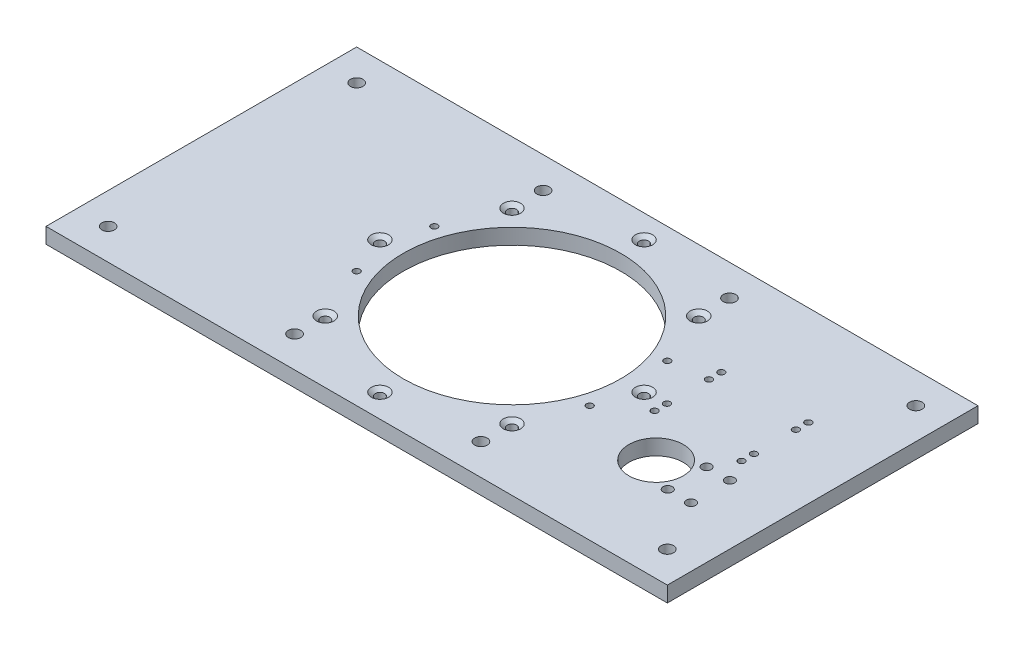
ISO-10303-21;
HEADER;
FILE_DESCRIPTION(('STEP AP214'),'2;1');
FILE_NAME('part.step','',(''),(''),'','','');
FILE_SCHEMA(('AUTOMOTIVE_DESIGN { 1 0 10303 214 1 1 1 1 }'));
ENDSEC;
DATA;
#1=APPLICATION_CONTEXT('core data for automotive mechanical design processes');
#2=APPLICATION_PROTOCOL_DEFINITION('international standard','automotive_design',2000,#1);
#3=PRODUCT_CONTEXT('',#1,'mechanical');
#4=PRODUCT('Part','Part','',(#3));
#5=PRODUCT_RELATED_PRODUCT_CATEGORY('part','',(#4));
#6=PRODUCT_DEFINITION_FORMATION('','',#4);
#7=PRODUCT_DEFINITION_CONTEXT('part definition',#1,'design');
#8=PRODUCT_DEFINITION('design','',#6,#7);
#9=PRODUCT_DEFINITION_SHAPE('','',#8);
#10=(LENGTH_UNIT() NAMED_UNIT(*) SI_UNIT(.MILLI.,.METRE.));
#11=(NAMED_UNIT(*) PLANE_ANGLE_UNIT() SI_UNIT($,.RADIAN.));
#12=(NAMED_UNIT(*) SI_UNIT($,.STERADIAN.) SOLID_ANGLE_UNIT());
#13=UNCERTAINTY_MEASURE_WITH_UNIT(LENGTH_MEASURE(1.E-05),#10,'distance_accuracy_value','');
#14=(GEOMETRIC_REPRESENTATION_CONTEXT(3) GLOBAL_UNCERTAINTY_ASSIGNED_CONTEXT((#13)) GLOBAL_UNIT_ASSIGNED_CONTEXT((#10,
#11,#12)) REPRESENTATION_CONTEXT('',''));
#15=CARTESIAN_POINT('',(0.,0.,0.));
#16=DIRECTION('',(0.,0.,1.));
#17=DIRECTION('',(1.,0.,0.));
#18=AXIS2_PLACEMENT_3D('',#15,#16,#17);
#19=CARTESIAN_POINT('',(-127.,6.35,-63.5));
#20=DIRECTION('',(0.,1.,0.));
#21=DIRECTION('',(0.,0.,1.));
#22=AXIS2_PLACEMENT_3D('',#19,#20,#21);
#23=PLANE('',#22);
#24=CARTESIAN_POINT('',(47.625,6.35,15.875));
#25=DIRECTION('',(0.,1.,0.));
#26=DIRECTION('',(0.,0.,1.));
#27=AXIS2_PLACEMENT_3D('',#24,#25,#26);
#28=CIRCLE('',#27,1.35254999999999);
#29=CARTESIAN_POINT('',(47.625,6.35,17.22755));
#30=VERTEX_POINT('',#29);
#31=EDGE_CURVE('E466',#30,#30,#28,.T.);
#32=ORIENTED_EDGE('',*,*,#31,.F.);
#33=EDGE_LOOP('',(#32));
#34=FACE_BOUND('',#33,.T.);
#35=CARTESIAN_POINT('',(47.625,6.35,-15.875));
#36=DIRECTION('',(0.,1.,0.));
#37=DIRECTION('',(0.,0.,1.));
#38=AXIS2_PLACEMENT_3D('',#35,#36,#37);
#39=CIRCLE('',#38,1.35254999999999);
#40=CARTESIAN_POINT('',(47.625,6.35,-14.52245));
#41=VERTEX_POINT('',#40);
#42=EDGE_CURVE('E460',#41,#41,#39,.T.);
#43=ORIENTED_EDGE('',*,*,#42,.F.);
#44=EDGE_LOOP('',(#43));
#45=FACE_BOUND('',#44,.T.);
#46=CARTESIAN_POINT('',(-47.625,6.35,-15.875));
#47=DIRECTION('',(0.,1.,0.));
#48=DIRECTION('',(0.,0.,1.));
#49=AXIS2_PLACEMENT_3D('',#46,#47,#48);
#50=CIRCLE('',#49,1.35254999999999);
#51=CARTESIAN_POINT('',(-47.625,6.35,-14.52245));
#52=VERTEX_POINT('',#51);
#53=EDGE_CURVE('E454',#52,#52,#50,.T.);
#54=ORIENTED_EDGE('',*,*,#53,.F.);
#55=EDGE_LOOP('',(#54));
#56=FACE_BOUND('',#55,.T.);
#57=CARTESIAN_POINT('',(-47.625,6.35,15.875));
#58=DIRECTION('',(0.,1.,0.));
#59=DIRECTION('',(0.,0.,1.));
#60=AXIS2_PLACEMENT_3D('',#57,#58,#59);
#61=CIRCLE('',#60,1.35254999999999);
#62=CARTESIAN_POINT('',(-47.625,6.35,17.22755));
#63=VERTEX_POINT('',#62);
#64=EDGE_CURVE('E448',#63,#63,#61,.T.);
#65=ORIENTED_EDGE('',*,*,#64,.F.);
#66=EDGE_LOOP('',(#65));
#67=FACE_BOUND('',#66,.T.);
#68=CARTESIAN_POINT('',(38.1660885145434,6.35,38.1660885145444));
#69=DIRECTION('',(0.,1.,0.));
#70=DIRECTION('',(0.,0.,1.));
#71=AXIS2_PLACEMENT_3D('',#68,#69,#70);
#72=CIRCLE('',#71,3.5433);
#73=CARTESIAN_POINT('',(38.1660885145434,6.35,41.7093885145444));
#74=VERTEX_POINT('',#73);
#75=EDGE_CURVE('E439',#74,#74,#72,.T.);
#76=ORIENTED_EDGE('',*,*,#75,.F.);
#77=EDGE_LOOP('',(#76));
#78=FACE_BOUND('',#77,.T.);
#79=CARTESIAN_POINT('',(53.975,6.35,5.65358443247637E-13));
#80=DIRECTION('',(0.,1.,0.));
#81=DIRECTION('',(0.,0.,1.));
#82=AXIS2_PLACEMENT_3D('',#79,#80,#81);
#83=CIRCLE('',#82,3.5433);
#84=CARTESIAN_POINT('',(53.975,6.35,3.54330000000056));
#85=VERTEX_POINT('',#84);
#86=EDGE_CURVE('E430',#85,#85,#83,.T.);
#87=ORIENTED_EDGE('',*,*,#86,.F.);
#88=EDGE_LOOP('',(#87));
#89=FACE_BOUND('',#88,.T.);
#90=CARTESIAN_POINT('',(38.1660885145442,6.35,-38.1660885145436));
#91=DIRECTION('',(0.,1.,0.));
#92=DIRECTION('',(0.,0.,1.));
#93=AXIS2_PLACEMENT_3D('',#90,#91,#92);
#94=CIRCLE('',#93,3.5433);
#95=CARTESIAN_POINT('',(38.1660885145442,6.35,-34.6227885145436));
#96=VERTEX_POINT('',#95);
#97=EDGE_CURVE('E421',#96,#96,#94,.T.);
#98=ORIENTED_EDGE('',*,*,#97,.F.);
#99=EDGE_LOOP('',(#98));
#100=FACE_BOUND('',#99,.T.);
#101=CARTESIAN_POINT('',(3.76905628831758E-13,6.35,-53.975));
#102=DIRECTION('',(0.,1.,0.));
#103=DIRECTION('',(0.,0.,1.));
#104=AXIS2_PLACEMENT_3D('',#101,#102,#103);
#105=CIRCLE('',#104,3.5433);
#106=CARTESIAN_POINT('',(3.76905628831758E-13,6.35,-50.4317));
#107=VERTEX_POINT('',#106);
#108=EDGE_CURVE('E412',#107,#107,#105,.T.);
#109=ORIENTED_EDGE('',*,*,#108,.F.);
#110=EDGE_LOOP('',(#109));
#111=FACE_BOUND('',#110,.T.);
#112=CARTESIAN_POINT('',(-38.1660885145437,6.35,-38.1660885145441));
#113=DIRECTION('',(0.,1.,0.));
#114=DIRECTION('',(0.,0.,1.));
#115=AXIS2_PLACEMENT_3D('',#112,#113,#114);
#116=CIRCLE('',#115,3.5433);
#117=CARTESIAN_POINT('',(-38.1660885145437,6.35,-34.6227885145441));
#118=VERTEX_POINT('',#117);
#119=EDGE_CURVE('E403',#118,#118,#116,.T.);
#120=ORIENTED_EDGE('',*,*,#119,.F.);
#121=EDGE_LOOP('',(#120));
#122=FACE_BOUND('',#121,.T.);
#123=CARTESIAN_POINT('',(-53.975,6.35,-1.88452814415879E-13));
#124=DIRECTION('',(0.,1.,0.));
#125=DIRECTION('',(0.,0.,1.));
#126=AXIS2_PLACEMENT_3D('',#123,#124,#125);
#127=CIRCLE('',#126,3.5433);
#128=CARTESIAN_POINT('',(-53.975,6.35,3.54329999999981));
#129=VERTEX_POINT('',#128);
#130=EDGE_CURVE('E394',#129,#129,#127,.T.);
#131=ORIENTED_EDGE('',*,*,#130,.F.);
#132=EDGE_LOOP('',(#131));
#133=FACE_BOUND('',#132,.T.);
#134=CARTESIAN_POINT('',(-38.166088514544,6.35,38.1660885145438));
#135=DIRECTION('',(0.,1.,0.));
#136=DIRECTION('',(0.,0.,1.));
#137=AXIS2_PLACEMENT_3D('',#134,#135,#136);
#138=CIRCLE('',#137,3.5433);
#139=CARTESIAN_POINT('',(-38.166088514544,6.35,41.7093885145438));
#140=VERTEX_POINT('',#139);
#141=EDGE_CURVE('E385',#140,#140,#138,.T.);
#142=ORIENTED_EDGE('',*,*,#141,.F.);
#143=EDGE_LOOP('',(#142));
#144=FACE_BOUND('',#143,.T.);
#145=CARTESIAN_POINT('',(0.,6.35,53.975));
#146=DIRECTION('',(0.,1.,0.));
#147=DIRECTION('',(0.,0.,1.));
#148=AXIS2_PLACEMENT_3D('',#145,#146,#147);
#149=CIRCLE('',#148,3.5433);
#150=CARTESIAN_POINT('',(0.,6.35,57.5183));
#151=VERTEX_POINT('',#150);
#152=EDGE_CURVE('E376',#151,#151,#149,.T.);
#153=ORIENTED_EDGE('',*,*,#152,.F.);
#154=EDGE_LOOP('',(#153));
#155=FACE_BOUND('',#154,.T.);
#156=CARTESIAN_POINT('',(38.1,6.35,50.8));
#157=DIRECTION('',(0.,1.,0.));
#158=DIRECTION('',(0.,0.,1.));
#159=AXIS2_PLACEMENT_3D('',#156,#157,#158);
#160=CIRCLE('',#159,2.55269999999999);
#161=CARTESIAN_POINT('',(38.1,6.35,53.3527));
#162=VERTEX_POINT('',#161);
#163=EDGE_CURVE('E373',#162,#162,#160,.T.);
#164=ORIENTED_EDGE('',*,*,#163,.F.);
#165=EDGE_LOOP('',(#164));
#166=FACE_BOUND('',#165,.T.);
#167=CARTESIAN_POINT('',(114.3,6.35,50.8));
#168=DIRECTION('',(0.,1.,0.));
#169=DIRECTION('',(0.,0.,1.));
#170=AXIS2_PLACEMENT_3D('',#167,#168,#169);
#171=CIRCLE('',#170,2.55269999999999);
#172=CARTESIAN_POINT('',(114.3,6.35,53.3527));
#173=VERTEX_POINT('',#172);
#174=EDGE_CURVE('E135',#173,#173,#171,.T.);
#175=ORIENTED_EDGE('',*,*,#174,.F.);
#176=EDGE_LOOP('',(#175));
#177=FACE_BOUND('',#176,.T.);
#178=CARTESIAN_POINT('',(98.253212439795,6.35,-22.8872677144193));
#179=DIRECTION('',(0.,1.,0.));
#180=DIRECTION('',(0.,0.,1.));
#181=AXIS2_PLACEMENT_3D('',#178,#179,#180);
#182=CIRCLE('',#181,1.35254999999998);
#183=CARTESIAN_POINT('',(98.253212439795,6.35,-21.5347177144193));
#184=VERTEX_POINT('',#183);
#185=EDGE_CURVE('E363',#184,#184,#182,.T.);
#186=ORIENTED_EDGE('',*,*,#185,.F.);
#187=EDGE_LOOP('',(#186));
#188=FACE_BOUND('',#187,.T.);
#189=CARTESIAN_POINT('',(62.693212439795,6.35,-17.8072677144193));
#190=DIRECTION('',(0.,1.,0.));
#191=DIRECTION('',(0.,0.,1.));
#192=AXIS2_PLACEMENT_3D('',#189,#190,#191);
#193=CIRCLE('',#192,1.35254999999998);
#194=CARTESIAN_POINT('',(62.693212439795,6.35,-16.4547177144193));
#195=VERTEX_POINT('',#194);
#196=EDGE_CURVE('E357',#195,#195,#193,.T.);
#197=ORIENTED_EDGE('',*,*,#196,.F.);
#198=EDGE_LOOP('',(#197));
#199=FACE_BOUND('',#198,.T.);
#200=CARTESIAN_POINT('',(98.253212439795,6.35,-17.8072677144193));
#201=DIRECTION('',(0.,1.,0.));
#202=DIRECTION('',(0.,0.,1.));
#203=AXIS2_PLACEMENT_3D('',#200,#201,#202);
#204=CIRCLE('',#203,1.35254999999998);
#205=CARTESIAN_POINT('',(98.253212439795,6.35,-16.4547177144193));
#206=VERTEX_POINT('',#205);
#207=EDGE_CURVE('E351',#206,#206,#204,.T.);
#208=ORIENTED_EDGE('',*,*,#207,.F.);
#209=EDGE_LOOP('',(#208));
#210=FACE_BOUND('',#209,.T.);
#211=CARTESIAN_POINT('',(62.693212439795,6.35,-22.8872677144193));
#212=DIRECTION('',(0.,1.,0.));
#213=DIRECTION('',(0.,0.,1.));
#214=AXIS2_PLACEMENT_3D('',#211,#212,#213);
#215=CIRCLE('',#214,1.35254999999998);
#216=CARTESIAN_POINT('',(62.693212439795,6.35,-21.5347177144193));
#217=VERTEX_POINT('',#216);
#218=EDGE_CURVE('E345',#217,#217,#215,.T.);
#219=ORIENTED_EDGE('',*,*,#218,.F.);
#220=EDGE_LOOP('',(#219));
#221=FACE_BOUND('',#220,.T.);
#222=CARTESIAN_POINT('',(62.693212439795,6.35,-0.662267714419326));
#223=DIRECTION('',(0.,1.,0.));
#224=DIRECTION('',(0.,0.,1.));
#225=AXIS2_PLACEMENT_3D('',#222,#223,#224);
#226=CIRCLE('',#225,1.35254999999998);
#227=CARTESIAN_POINT('',(62.693212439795,6.35,0.690282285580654));
#228=VERTEX_POINT('',#227);
#229=EDGE_CURVE('E339',#228,#228,#226,.T.);
#230=ORIENTED_EDGE('',*,*,#229,.F.);
#231=EDGE_LOOP('',(#230));
#232=FACE_BOUND('',#231,.T.);
#233=CARTESIAN_POINT('',(98.253212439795,6.35,-0.66226771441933));
#234=DIRECTION('',(0.,1.,0.));
#235=DIRECTION('',(0.,0.,1.));
#236=AXIS2_PLACEMENT_3D('',#233,#234,#235);
#237=CIRCLE('',#236,1.35254999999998);
#238=CARTESIAN_POINT('',(98.253212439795,6.35,0.69028228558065));
#239=VERTEX_POINT('',#238);
#240=EDGE_CURVE('E333',#239,#239,#237,.T.);
#241=ORIENTED_EDGE('',*,*,#240,.F.);
#242=EDGE_LOOP('',(#241));
#243=FACE_BOUND('',#242,.T.);
#244=CARTESIAN_POINT('',(62.693212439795,6.35,4.41773228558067));
#245=DIRECTION('',(0.,1.,0.));
#246=DIRECTION('',(0.,0.,1.));
#247=AXIS2_PLACEMENT_3D('',#244,#245,#246);
#248=CIRCLE('',#247,1.35254999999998);
#249=CARTESIAN_POINT('',(62.693212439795,6.35,5.77028228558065));
#250=VERTEX_POINT('',#249);
#251=EDGE_CURVE('E327',#250,#250,#248,.T.);
#252=ORIENTED_EDGE('',*,*,#251,.F.);
#253=EDGE_LOOP('',(#252));
#254=FACE_BOUND('',#253,.T.);
#255=CARTESIAN_POINT('',(98.253212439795,6.35,4.41773228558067));
#256=DIRECTION('',(0.,1.,0.));
#257=DIRECTION('',(0.,0.,1.));
#258=AXIS2_PLACEMENT_3D('',#255,#256,#257);
#259=CIRCLE('',#258,1.35254999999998);
#260=CARTESIAN_POINT('',(98.253212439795,6.35,5.77028228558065));
#261=VERTEX_POINT('',#260);
#262=EDGE_CURVE('E321',#261,#261,#259,.T.);
#263=ORIENTED_EDGE('',*,*,#262,.F.);
#264=EDGE_LOOP('',(#263));
#265=FACE_BOUND('',#264,.T.);
#266=CARTESIAN_POINT('',(93.173212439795,6.35,13.6252322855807));
#267=DIRECTION('',(0.,1.,0.));
#268=DIRECTION('',(0.,0.,1.));
#269=AXIS2_PLACEMENT_3D('',#266,#267,#268);
#270=CIRCLE('',#269,1.89864999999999);
#271=CARTESIAN_POINT('',(93.173212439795,6.35,15.5238822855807));
#272=VERTEX_POINT('',#271);
#273=EDGE_CURVE('E130',#272,#272,#270,.T.);
#274=ORIENTED_EDGE('',*,*,#273,.F.);
#275=EDGE_LOOP('',(#274));
#276=FACE_BOUND('',#275,.T.);
#277=CARTESIAN_POINT('',(93.173212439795,6.35,29.5002322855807));
#278=DIRECTION('',(0.,1.,0.));
#279=DIRECTION('',(0.,0.,1.));
#280=AXIS2_PLACEMENT_3D('',#277,#278,#279);
#281=CIRCLE('',#280,1.89864999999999);
#282=CARTESIAN_POINT('',(93.173212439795,6.35,31.3988822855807));
#283=VERTEX_POINT('',#282);
#284=EDGE_CURVE('E126',#283,#283,#281,.T.);
#285=ORIENTED_EDGE('',*,*,#284,.F.);
#286=EDGE_LOOP('',(#285));
#287=FACE_BOUND('',#286,.T.);
#288=CARTESIAN_POINT('',(102.698212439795,6.35,13.6252322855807));
#289=DIRECTION('',(0.,1.,0.));
#290=DIRECTION('',(0.,0.,1.));
#291=AXIS2_PLACEMENT_3D('',#288,#289,#290);
#292=CIRCLE('',#291,1.89864999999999);
#293=CARTESIAN_POINT('',(102.698212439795,6.35,15.5238822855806));
#294=VERTEX_POINT('',#293);
#295=EDGE_CURVE('E122',#294,#294,#292,.T.);
#296=ORIENTED_EDGE('',*,*,#295,.F.);
#297=EDGE_LOOP('',(#296));
#298=FACE_BOUND('',#297,.T.);
#299=CARTESIAN_POINT('',(102.698212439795,6.35,29.5002322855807));
#300=DIRECTION('',(0.,1.,0.));
#301=DIRECTION('',(0.,0.,1.));
#302=AXIS2_PLACEMENT_3D('',#299,#300,#301);
#303=CIRCLE('',#302,1.89864999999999);
#304=CARTESIAN_POINT('',(102.698212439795,6.35,31.3988822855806));
#305=VERTEX_POINT('',#304);
#306=EDGE_CURVE('E118',#305,#305,#303,.T.);
#307=ORIENTED_EDGE('',*,*,#306,.F.);
#308=EDGE_LOOP('',(#307));
#309=FACE_BOUND('',#308,.T.);
#310=CARTESIAN_POINT('',(80.473212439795,6.35,21.5627322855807));
#311=DIRECTION('',(0.,1.,0.));
#312=DIRECTION('',(0.,0.,1.));
#313=AXIS2_PLACEMENT_3D('',#310,#311,#312);
#314=CIRCLE('',#313,11.1125);
#315=CARTESIAN_POINT('',(80.473212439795,6.35,32.6752322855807));
#316=VERTEX_POINT('',#315);
#317=EDGE_CURVE('E117',#316,#316,#314,.T.);
#318=ORIENTED_EDGE('',*,*,#317,.F.);
#319=EDGE_LOOP('',(#318));
#320=FACE_BOUND('',#319,.T.);
#321=DIRECTION('',(0.,0.,1.));
#322=VECTOR('',#321,1.);
#323=CARTESIAN_POINT('',(-127.,6.35,-63.5));
#324=LINE('',#323,#322);
#325=CARTESIAN_POINT('',(-127.,6.35,-63.5));
#326=VERTEX_POINT('',#325);
#327=CARTESIAN_POINT('',(-127.,6.35,63.5));
#328=VERTEX_POINT('',#327);
#329=EDGE_CURVE('E104',#326,#328,#324,.T.);
#330=ORIENTED_EDGE('',*,*,#329,.T.);
#331=DIRECTION('',(1.,0.,0.));
#332=VECTOR('',#331,1.);
#333=CARTESIAN_POINT('',(-127.,6.35,63.5));
#334=LINE('',#333,#332);
#335=CARTESIAN_POINT('',(127.,6.35,63.5));
#336=VERTEX_POINT('',#335);
#337=EDGE_CURVE('E85',#328,#336,#334,.T.);
#338=ORIENTED_EDGE('',*,*,#337,.T.);
#339=DIRECTION('',(0.,0.,-1.));
#340=VECTOR('',#339,1.);
#341=CARTESIAN_POINT('',(127.,6.35,-63.5));
#342=LINE('',#341,#340);
#343=CARTESIAN_POINT('',(127.,6.35,-63.5));
#344=VERTEX_POINT('',#343);
#345=EDGE_CURVE('E49',#336,#344,#342,.T.);
#346=ORIENTED_EDGE('',*,*,#345,.T.);
#347=DIRECTION('',(-1.,0.,0.));
#348=VECTOR('',#347,1.);
#349=CARTESIAN_POINT('',(-127.,6.35,-63.5));
#350=LINE('',#349,#348);
#351=EDGE_CURVE('E44',#344,#326,#350,.T.);
#352=ORIENTED_EDGE('',*,*,#351,.T.);
#353=EDGE_LOOP('',(#330,#338,#346,#352));
#354=FACE_BOUND('',#353,.T.);
#355=CARTESIAN_POINT('',(0.,6.35,0.));
#356=DIRECTION('',(0.,1.,0.));
#357=DIRECTION('',(0.,0.,1.));
#358=AXIS2_PLACEMENT_3D('',#355,#356,#357);
#359=CIRCLE('',#358,44.45);
#360=CARTESIAN_POINT('',(0.,6.35,44.45));
#361=VERTEX_POINT('',#360);
#362=EDGE_CURVE('E94',#361,#361,#359,.T.);
#363=ORIENTED_EDGE('',*,*,#362,.F.);
#364=EDGE_LOOP('',(#363));
#365=FACE_BOUND('',#364,.T.);
#366=CARTESIAN_POINT('',(-38.1,6.35,50.8));
#367=DIRECTION('',(0.,1.,0.));
#368=DIRECTION('',(0.,0.,1.));
#369=AXIS2_PLACEMENT_3D('',#366,#367,#368);
#370=CIRCLE('',#369,2.55269999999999);
#371=CARTESIAN_POINT('',(-38.1,6.35,53.3527));
#372=VERTEX_POINT('',#371);
#373=EDGE_CURVE('E88',#372,#372,#370,.T.);
#374=ORIENTED_EDGE('',*,*,#373,.F.);
#375=EDGE_LOOP('',(#374));
#376=FACE_BOUND('',#375,.T.);
#377=CARTESIAN_POINT('',(-114.3,6.35,50.8));
#378=DIRECTION('',(0.,1.,0.));
#379=DIRECTION('',(0.,0.,1.));
#380=AXIS2_PLACEMENT_3D('',#377,#378,#379);
#381=CIRCLE('',#380,2.55269999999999);
#382=CARTESIAN_POINT('',(-114.3,6.35,53.3527));
#383=VERTEX_POINT('',#382);
#384=EDGE_CURVE('E141',#383,#383,#381,.T.);
#385=ORIENTED_EDGE('',*,*,#384,.F.);
#386=EDGE_LOOP('',(#385));
#387=FACE_BOUND('',#386,.T.);
#388=CARTESIAN_POINT('',(114.3,6.35,-50.8));
#389=DIRECTION('',(0.,1.,0.));
#390=DIRECTION('',(0.,0.,1.));
#391=AXIS2_PLACEMENT_3D('',#388,#389,#390);
#392=CIRCLE('',#391,2.55269999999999);
#393=CARTESIAN_POINT('',(114.3,6.35,-48.2473));
#394=VERTEX_POINT('',#393);
#395=EDGE_CURVE('E147',#394,#394,#392,.T.);
#396=ORIENTED_EDGE('',*,*,#395,.F.);
#397=EDGE_LOOP('',(#396));
#398=FACE_BOUND('',#397,.T.);
#399=CARTESIAN_POINT('',(38.1,6.35,-50.8));
#400=DIRECTION('',(0.,1.,0.));
#401=DIRECTION('',(0.,0.,1.));
#402=AXIS2_PLACEMENT_3D('',#399,#400,#401);
#403=CIRCLE('',#402,2.55269999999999);
#404=CARTESIAN_POINT('',(38.1,6.35,-48.2473));
#405=VERTEX_POINT('',#404);
#406=EDGE_CURVE('E153',#405,#405,#403,.T.);
#407=ORIENTED_EDGE('',*,*,#406,.F.);
#408=EDGE_LOOP('',(#407));
#409=FACE_BOUND('',#408,.T.);
#410=CARTESIAN_POINT('',(-38.1,6.35,-50.8));
#411=DIRECTION('',(0.,1.,0.));
#412=DIRECTION('',(0.,0.,1.));
#413=AXIS2_PLACEMENT_3D('',#410,#411,#412);
#414=CIRCLE('',#413,2.55269999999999);
#415=CARTESIAN_POINT('',(-38.1,6.35,-48.2473));
#416=VERTEX_POINT('',#415);
#417=EDGE_CURVE('E159',#416,#416,#414,.T.);
#418=ORIENTED_EDGE('',*,*,#417,.F.);
#419=EDGE_LOOP('',(#418));
#420=FACE_BOUND('',#419,.T.);
#421=CARTESIAN_POINT('',(-114.3,6.35,-50.8));
#422=DIRECTION('',(0.,1.,0.));
#423=DIRECTION('',(0.,0.,1.));
#424=AXIS2_PLACEMENT_3D('',#421,#422,#423);
#425=CIRCLE('',#424,2.55269999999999);
#426=CARTESIAN_POINT('',(-114.3,6.35,-48.2473));
#427=VERTEX_POINT('',#426);
#428=EDGE_CURVE('E37',#427,#427,#425,.T.);
#429=ORIENTED_EDGE('',*,*,#428,.F.);
#430=EDGE_LOOP('',(#429));
#431=FACE_BOUND('',#430,.T.);
#432=ADVANCED_FACE('F29',(#34,#45,#56,#67,#78,#89,#100,#111,#122,#133,#144,#155,#166,#177,#188,
#199,#210,#221,#232,#243,#254,#265,#276,#287,#298,#309,#320,#354,#365,#376,#387,#398,#409,#420,
#431),#23,.T.);
#433=CARTESIAN_POINT('',(-127.,0.,-63.5));
#434=DIRECTION('',(0.,1.,0.));
#435=DIRECTION('',(0.,0.,1.));
#436=AXIS2_PLACEMENT_3D('',#433,#434,#435);
#437=PLANE('',#436);
#438=CARTESIAN_POINT('',(47.625,0.,15.875));
#439=DIRECTION('',(0.,1.,0.));
#440=DIRECTION('',(0.,0.,1.));
#441=AXIS2_PLACEMENT_3D('',#438,#439,#440);
#442=CIRCLE('',#441,1.35255);
#443=CARTESIAN_POINT('',(47.625,0.,17.22755));
#444=VERTEX_POINT('',#443);
#445=EDGE_CURVE('E469',#444,#444,#442,.T.);
#446=ORIENTED_EDGE('',*,*,#445,.T.);
#447=EDGE_LOOP('',(#446));
#448=FACE_BOUND('',#447,.T.);
#449=CARTESIAN_POINT('',(47.625,0.,-15.875));
#450=DIRECTION('',(0.,1.,0.));
#451=DIRECTION('',(0.,0.,1.));
#452=AXIS2_PLACEMENT_3D('',#449,#450,#451);
#453=CIRCLE('',#452,1.35255);
#454=CARTESIAN_POINT('',(47.625,0.,-14.52245));
#455=VERTEX_POINT('',#454);
#456=EDGE_CURVE('E463',#455,#455,#453,.T.);
#457=ORIENTED_EDGE('',*,*,#456,.T.);
#458=EDGE_LOOP('',(#457));
#459=FACE_BOUND('',#458,.T.);
#460=CARTESIAN_POINT('',(-47.625,0.,-15.875));
#461=DIRECTION('',(0.,1.,0.));
#462=DIRECTION('',(0.,0.,1.));
#463=AXIS2_PLACEMENT_3D('',#460,#461,#462);
#464=CIRCLE('',#463,1.35255);
#465=CARTESIAN_POINT('',(-47.625,0.,-14.52245));
#466=VERTEX_POINT('',#465);
#467=EDGE_CURVE('E457',#466,#466,#464,.T.);
#468=ORIENTED_EDGE('',*,*,#467,.T.);
#469=EDGE_LOOP('',(#468));
#470=FACE_BOUND('',#469,.T.);
#471=CARTESIAN_POINT('',(-47.625,0.,15.875));
#472=DIRECTION('',(0.,1.,0.));
#473=DIRECTION('',(0.,0.,1.));
#474=AXIS2_PLACEMENT_3D('',#471,#472,#473);
#475=CIRCLE('',#474,1.35255);
#476=CARTESIAN_POINT('',(-47.625,0.,17.22755));
#477=VERTEX_POINT('',#476);
#478=EDGE_CURVE('E451',#477,#477,#475,.T.);
#479=ORIENTED_EDGE('',*,*,#478,.T.);
#480=EDGE_LOOP('',(#479));
#481=FACE_BOUND('',#480,.T.);
#482=CARTESIAN_POINT('',(38.1660885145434,0.,38.1660885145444));
#483=DIRECTION('',(0.,1.,0.));
#484=DIRECTION('',(0.,0.,1.));
#485=AXIS2_PLACEMENT_3D('',#482,#483,#484);
#486=CIRCLE('',#485,1.89864999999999);
#487=CARTESIAN_POINT('',(38.1660885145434,0.,40.0647385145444));
#488=VERTEX_POINT('',#487);
#489=EDGE_CURVE('E445',#488,#488,#486,.T.);
#490=ORIENTED_EDGE('',*,*,#489,.T.);
#491=EDGE_LOOP('',(#490));
#492=FACE_BOUND('',#491,.T.);
#493=CARTESIAN_POINT('',(53.975,0.,5.65358443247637E-13));
#494=DIRECTION('',(0.,1.,0.));
#495=DIRECTION('',(0.,0.,1.));
#496=AXIS2_PLACEMENT_3D('',#493,#494,#495);
#497=CIRCLE('',#496,1.89864999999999);
#498=CARTESIAN_POINT('',(53.975,0.,1.89865000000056));
#499=VERTEX_POINT('',#498);
#500=EDGE_CURVE('E436',#499,#499,#497,.T.);
#501=ORIENTED_EDGE('',*,*,#500,.T.);
#502=EDGE_LOOP('',(#501));
#503=FACE_BOUND('',#502,.T.);
#504=CARTESIAN_POINT('',(38.1660885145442,0.,-38.1660885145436));
#505=DIRECTION('',(0.,1.,0.));
#506=DIRECTION('',(0.,0.,1.));
#507=AXIS2_PLACEMENT_3D('',#504,#505,#506);
#508=CIRCLE('',#507,1.89864999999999);
#509=CARTESIAN_POINT('',(38.1660885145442,0.,-36.2674385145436));
#510=VERTEX_POINT('',#509);
#511=EDGE_CURVE('E427',#510,#510,#508,.T.);
#512=ORIENTED_EDGE('',*,*,#511,.T.);
#513=EDGE_LOOP('',(#512));
#514=FACE_BOUND('',#513,.T.);
#515=CARTESIAN_POINT('',(3.76905628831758E-13,0.,-53.975));
#516=DIRECTION('',(0.,1.,0.));
#517=DIRECTION('',(0.,0.,1.));
#518=AXIS2_PLACEMENT_3D('',#515,#516,#517);
#519=CIRCLE('',#518,1.89865);
#520=CARTESIAN_POINT('',(3.76905628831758E-13,0.,-52.07635));
#521=VERTEX_POINT('',#520);
#522=EDGE_CURVE('E418',#521,#521,#519,.T.);
#523=ORIENTED_EDGE('',*,*,#522,.T.);
#524=EDGE_LOOP('',(#523));
#525=FACE_BOUND('',#524,.T.);
#526=CARTESIAN_POINT('',(-38.1660885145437,0.,-38.1660885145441));
#527=DIRECTION('',(0.,1.,0.));
#528=DIRECTION('',(0.,0.,1.));
#529=AXIS2_PLACEMENT_3D('',#526,#527,#528);
#530=CIRCLE('',#529,1.89864999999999);
#531=CARTESIAN_POINT('',(-38.1660885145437,0.,-36.2674385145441));
#532=VERTEX_POINT('',#531);
#533=EDGE_CURVE('E409',#532,#532,#530,.T.);
#534=ORIENTED_EDGE('',*,*,#533,.T.);
#535=EDGE_LOOP('',(#534));
#536=FACE_BOUND('',#535,.T.);
#537=CARTESIAN_POINT('',(-53.975,0.,-1.88452814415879E-13));
#538=DIRECTION('',(0.,1.,0.));
#539=DIRECTION('',(0.,0.,1.));
#540=AXIS2_PLACEMENT_3D('',#537,#538,#539);
#541=CIRCLE('',#540,1.89864999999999);
#542=CARTESIAN_POINT('',(-53.975,0.,1.89864999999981));
#543=VERTEX_POINT('',#542);
#544=EDGE_CURVE('E400',#543,#543,#541,.T.);
#545=ORIENTED_EDGE('',*,*,#544,.T.);
#546=EDGE_LOOP('',(#545));
#547=FACE_BOUND('',#546,.T.);
#548=CARTESIAN_POINT('',(-38.166088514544,0.,38.1660885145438));
#549=DIRECTION('',(0.,1.,0.));
#550=DIRECTION('',(0.,0.,1.));
#551=AXIS2_PLACEMENT_3D('',#548,#549,#550);
#552=CIRCLE('',#551,1.89864999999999);
#553=CARTESIAN_POINT('',(-38.166088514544,0.,40.0647385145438));
#554=VERTEX_POINT('',#553);
#555=EDGE_CURVE('E391',#554,#554,#552,.T.);
#556=ORIENTED_EDGE('',*,*,#555,.T.);
#557=EDGE_LOOP('',(#556));
#558=FACE_BOUND('',#557,.T.);
#559=CARTESIAN_POINT('',(0.,0.,53.975));
#560=DIRECTION('',(0.,1.,0.));
#561=DIRECTION('',(0.,0.,1.));
#562=AXIS2_PLACEMENT_3D('',#559,#560,#561);
#563=CIRCLE('',#562,1.89865);
#564=CARTESIAN_POINT('',(0.,0.,55.87365));
#565=VERTEX_POINT('',#564);
#566=EDGE_CURVE('E382',#565,#565,#563,.T.);
#567=ORIENTED_EDGE('',*,*,#566,.T.);
#568=EDGE_LOOP('',(#567));
#569=FACE_BOUND('',#568,.T.);
#570=CARTESIAN_POINT('',(38.1,0.,50.8));
#571=DIRECTION('',(0.,1.,0.));
#572=DIRECTION('',(0.,0.,1.));
#573=AXIS2_PLACEMENT_3D('',#570,#571,#572);
#574=CIRCLE('',#573,2.55269999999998);
#575=CARTESIAN_POINT('',(38.1,0.,53.3527));
#576=VERTEX_POINT('',#575);
#577=EDGE_CURVE('E370',#576,#576,#574,.T.);
#578=ORIENTED_EDGE('',*,*,#577,.T.);
#579=EDGE_LOOP('',(#578));
#580=FACE_BOUND('',#579,.T.);
#581=CARTESIAN_POINT('',(114.3,0.,50.8));
#582=DIRECTION('',(0.,1.,0.));
#583=DIRECTION('',(0.,0.,1.));
#584=AXIS2_PLACEMENT_3D('',#581,#582,#583);
#585=CIRCLE('',#584,2.55269999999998);
#586=CARTESIAN_POINT('',(114.3,0.,53.3527));
#587=VERTEX_POINT('',#586);
#588=EDGE_CURVE('E131',#587,#587,#585,.T.);
#589=ORIENTED_EDGE('',*,*,#588,.T.);
#590=EDGE_LOOP('',(#589));
#591=FACE_BOUND('',#590,.T.);
#592=CARTESIAN_POINT('',(98.253212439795,0.,-22.8872677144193));
#593=DIRECTION('',(0.,1.,0.));
#594=DIRECTION('',(0.,0.,1.));
#595=AXIS2_PLACEMENT_3D('',#592,#593,#594);
#596=CIRCLE('',#595,1.35254999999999);
#597=CARTESIAN_POINT('',(98.253212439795,0.,-21.5347177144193));
#598=VERTEX_POINT('',#597);
#599=EDGE_CURVE('E134',#598,#598,#596,.T.);
#600=ORIENTED_EDGE('',*,*,#599,.T.);
#601=EDGE_LOOP('',(#600));
#602=FACE_BOUND('',#601,.T.);
#603=CARTESIAN_POINT('',(62.693212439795,0.,-17.8072677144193));
#604=DIRECTION('',(0.,1.,0.));
#605=DIRECTION('',(0.,0.,1.));
#606=AXIS2_PLACEMENT_3D('',#603,#604,#605);
#607=CIRCLE('',#606,1.35254999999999);
#608=CARTESIAN_POINT('',(62.693212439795,0.,-16.4547177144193));
#609=VERTEX_POINT('',#608);
#610=EDGE_CURVE('E360',#609,#609,#607,.T.);
#611=ORIENTED_EDGE('',*,*,#610,.T.);
#612=EDGE_LOOP('',(#611));
#613=FACE_BOUND('',#612,.T.);
#614=CARTESIAN_POINT('',(98.253212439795,0.,-17.8072677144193));
#615=DIRECTION('',(0.,1.,0.));
#616=DIRECTION('',(0.,0.,1.));
#617=AXIS2_PLACEMENT_3D('',#614,#615,#616);
#618=CIRCLE('',#617,1.35254999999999);
#619=CARTESIAN_POINT('',(98.253212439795,0.,-16.4547177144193));
#620=VERTEX_POINT('',#619);
#621=EDGE_CURVE('E354',#620,#620,#618,.T.);
#622=ORIENTED_EDGE('',*,*,#621,.T.);
#623=EDGE_LOOP('',(#622));
#624=FACE_BOUND('',#623,.T.);
#625=CARTESIAN_POINT('',(62.693212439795,0.,-22.8872677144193));
#626=DIRECTION('',(0.,1.,0.));
#627=DIRECTION('',(0.,0.,1.));
#628=AXIS2_PLACEMENT_3D('',#625,#626,#627);
#629=CIRCLE('',#628,1.35254999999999);
#630=CARTESIAN_POINT('',(62.693212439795,0.,-21.5347177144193));
#631=VERTEX_POINT('',#630);
#632=EDGE_CURVE('E348',#631,#631,#629,.T.);
#633=ORIENTED_EDGE('',*,*,#632,.T.);
#634=EDGE_LOOP('',(#633));
#635=FACE_BOUND('',#634,.T.);
#636=CARTESIAN_POINT('',(62.693212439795,0.,-0.662267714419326));
#637=DIRECTION('',(0.,1.,0.));
#638=DIRECTION('',(0.,0.,1.));
#639=AXIS2_PLACEMENT_3D('',#636,#637,#638);
#640=CIRCLE('',#639,1.35254999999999);
#641=CARTESIAN_POINT('',(62.693212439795,0.,0.690282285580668));
#642=VERTEX_POINT('',#641);
#643=EDGE_CURVE('E342',#642,#642,#640,.T.);
#644=ORIENTED_EDGE('',*,*,#643,.T.);
#645=EDGE_LOOP('',(#644));
#646=FACE_BOUND('',#645,.T.);
#647=CARTESIAN_POINT('',(98.253212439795,0.,-0.66226771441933));
#648=DIRECTION('',(0.,1.,0.));
#649=DIRECTION('',(0.,0.,1.));
#650=AXIS2_PLACEMENT_3D('',#647,#648,#649);
#651=CIRCLE('',#650,1.35254999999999);
#652=CARTESIAN_POINT('',(98.253212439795,0.,0.690282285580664));
#653=VERTEX_POINT('',#652);
#654=EDGE_CURVE('E336',#653,#653,#651,.T.);
#655=ORIENTED_EDGE('',*,*,#654,.T.);
#656=EDGE_LOOP('',(#655));
#657=FACE_BOUND('',#656,.T.);
#658=CARTESIAN_POINT('',(62.693212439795,0.,4.41773228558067));
#659=DIRECTION('',(0.,1.,0.));
#660=DIRECTION('',(0.,0.,1.));
#661=AXIS2_PLACEMENT_3D('',#658,#659,#660);
#662=CIRCLE('',#661,1.35254999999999);
#663=CARTESIAN_POINT('',(62.693212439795,0.,5.77028228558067));
#664=VERTEX_POINT('',#663);
#665=EDGE_CURVE('E330',#664,#664,#662,.T.);
#666=ORIENTED_EDGE('',*,*,#665,.T.);
#667=EDGE_LOOP('',(#666));
#668=FACE_BOUND('',#667,.T.);
#669=CARTESIAN_POINT('',(98.253212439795,0.,4.41773228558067));
#670=DIRECTION('',(0.,1.,0.));
#671=DIRECTION('',(0.,0.,1.));
#672=AXIS2_PLACEMENT_3D('',#669,#670,#671);
#673=CIRCLE('',#672,1.35254999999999);
#674=CARTESIAN_POINT('',(98.253212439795,0.,5.77028228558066));
#675=VERTEX_POINT('',#674);
#676=EDGE_CURVE('E324',#675,#675,#673,.T.);
#677=ORIENTED_EDGE('',*,*,#676,.T.);
#678=EDGE_LOOP('',(#677));
#679=FACE_BOUND('',#678,.T.);
#680=CARTESIAN_POINT('',(93.173212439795,0.,13.6252322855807));
#681=DIRECTION('',(0.,1.,0.));
#682=DIRECTION('',(0.,0.,1.));
#683=AXIS2_PLACEMENT_3D('',#680,#681,#682);
#684=CIRCLE('',#683,1.89864999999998);
#685=CARTESIAN_POINT('',(93.173212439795,0.,15.5238822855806));
#686=VERTEX_POINT('',#685);
#687=EDGE_CURVE('E127',#686,#686,#684,.T.);
#688=ORIENTED_EDGE('',*,*,#687,.T.);
#689=EDGE_LOOP('',(#688));
#690=FACE_BOUND('',#689,.T.);
#691=CARTESIAN_POINT('',(93.173212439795,0.,29.5002322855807));
#692=DIRECTION('',(0.,1.,0.));
#693=DIRECTION('',(0.,0.,1.));
#694=AXIS2_PLACEMENT_3D('',#691,#692,#693);
#695=CIRCLE('',#694,1.89864999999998);
#696=CARTESIAN_POINT('',(93.173212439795,0.,31.3988822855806));
#697=VERTEX_POINT('',#696);
#698=EDGE_CURVE('E123',#697,#697,#695,.T.);
#699=ORIENTED_EDGE('',*,*,#698,.T.);
#700=EDGE_LOOP('',(#699));
#701=FACE_BOUND('',#700,.T.);
#702=CARTESIAN_POINT('',(102.698212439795,0.,13.6252322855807));
#703=DIRECTION('',(0.,1.,0.));
#704=DIRECTION('',(0.,0.,1.));
#705=AXIS2_PLACEMENT_3D('',#702,#703,#704);
#706=CIRCLE('',#705,1.89864999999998);
#707=CARTESIAN_POINT('',(102.698212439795,0.,15.5238822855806));
#708=VERTEX_POINT('',#707);
#709=EDGE_CURVE('E119',#708,#708,#706,.T.);
#710=ORIENTED_EDGE('',*,*,#709,.T.);
#711=EDGE_LOOP('',(#710));
#712=FACE_BOUND('',#711,.T.);
#713=CARTESIAN_POINT('',(102.698212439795,0.,29.5002322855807));
#714=DIRECTION('',(0.,1.,0.));
#715=DIRECTION('',(0.,0.,1.));
#716=AXIS2_PLACEMENT_3D('',#713,#714,#715);
#717=CIRCLE('',#716,1.89864999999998);
#718=CARTESIAN_POINT('',(102.698212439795,0.,31.3988822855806));
#719=VERTEX_POINT('',#718);
#720=EDGE_CURVE('E114',#719,#719,#717,.T.);
#721=ORIENTED_EDGE('',*,*,#720,.T.);
#722=EDGE_LOOP('',(#721));
#723=FACE_BOUND('',#722,.T.);
#724=CARTESIAN_POINT('',(80.473212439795,0.,21.5627322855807));
#725=DIRECTION('',(0.,1.,0.));
#726=DIRECTION('',(0.,0.,1.));
#727=AXIS2_PLACEMENT_3D('',#724,#725,#726);
#728=CIRCLE('',#727,11.1125);
#729=CARTESIAN_POINT('',(80.473212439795,0.,32.6752322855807));
#730=VERTEX_POINT('',#729);
#731=EDGE_CURVE('E307',#730,#730,#728,.T.);
#732=ORIENTED_EDGE('',*,*,#731,.T.);
#733=EDGE_LOOP('',(#732));
#734=FACE_BOUND('',#733,.T.);
#735=DIRECTION('',(0.,0.,1.));
#736=VECTOR('',#735,1.);
#737=CARTESIAN_POINT('',(-127.,0.,-63.5));
#738=LINE('',#737,#736);
#739=CARTESIAN_POINT('',(-127.,0.,-63.5));
#740=VERTEX_POINT('',#739);
#741=CARTESIAN_POINT('',(-127.,0.,63.5));
#742=VERTEX_POINT('',#741);
#743=EDGE_CURVE('E76',#740,#742,#738,.T.);
#744=ORIENTED_EDGE('',*,*,#743,.F.);
#745=DIRECTION('',(-1.,0.,0.));
#746=VECTOR('',#745,1.);
#747=CARTESIAN_POINT('',(-127.,0.,-63.5));
#748=LINE('',#747,#746);
#749=CARTESIAN_POINT('',(127.,0.,-63.5));
#750=VERTEX_POINT('',#749);
#751=EDGE_CURVE('E102',#750,#740,#748,.T.);
#752=ORIENTED_EDGE('',*,*,#751,.F.);
#753=DIRECTION('',(0.,0.,-1.));
#754=VECTOR('',#753,1.);
#755=CARTESIAN_POINT('',(127.,0.,-63.5));
#756=LINE('',#755,#754);
#757=CARTESIAN_POINT('',(127.,0.,63.5));
#758=VERTEX_POINT('',#757);
#759=EDGE_CURVE('E77',#758,#750,#756,.T.);
#760=ORIENTED_EDGE('',*,*,#759,.F.);
#761=DIRECTION('',(1.,0.,0.));
#762=VECTOR('',#761,1.);
#763=CARTESIAN_POINT('',(-127.,0.,63.5));
#764=LINE('',#763,#762);
#765=EDGE_CURVE('E70',#742,#758,#764,.T.);
#766=ORIENTED_EDGE('',*,*,#765,.F.);
#767=EDGE_LOOP('',(#744,#752,#760,#766));
#768=FACE_BOUND('',#767,.T.);
#769=CARTESIAN_POINT('',(0.,0.,0.));
#770=DIRECTION('',(0.,1.,0.));
#771=DIRECTION('',(0.,0.,1.));
#772=AXIS2_PLACEMENT_3D('',#769,#770,#771);
#773=CIRCLE('',#772,44.45);
#774=CARTESIAN_POINT('',(0.,0.,44.45));
#775=VERTEX_POINT('',#774);
#776=EDGE_CURVE('E97',#775,#775,#773,.T.);
#777=ORIENTED_EDGE('',*,*,#776,.T.);
#778=EDGE_LOOP('',(#777));
#779=FACE_BOUND('',#778,.T.);
#780=CARTESIAN_POINT('',(-38.1,0.,50.8));
#781=DIRECTION('',(0.,1.,0.));
#782=DIRECTION('',(0.,0.,1.));
#783=AXIS2_PLACEMENT_3D('',#780,#781,#782);
#784=CIRCLE('',#783,2.55269999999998);
#785=CARTESIAN_POINT('',(-38.1,0.,53.3527));
#786=VERTEX_POINT('',#785);
#787=EDGE_CURVE('E138',#786,#786,#784,.T.);
#788=ORIENTED_EDGE('',*,*,#787,.T.);
#789=EDGE_LOOP('',(#788));
#790=FACE_BOUND('',#789,.T.);
#791=CARTESIAN_POINT('',(-114.3,0.,50.8));
#792=DIRECTION('',(0.,1.,0.));
#793=DIRECTION('',(0.,0.,1.));
#794=AXIS2_PLACEMENT_3D('',#791,#792,#793);
#795=CIRCLE('',#794,2.55269999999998);
#796=CARTESIAN_POINT('',(-114.3,0.,53.3527));
#797=VERTEX_POINT('',#796);
#798=EDGE_CURVE('E144',#797,#797,#795,.T.);
#799=ORIENTED_EDGE('',*,*,#798,.T.);
#800=EDGE_LOOP('',(#799));
#801=FACE_BOUND('',#800,.T.);
#802=CARTESIAN_POINT('',(114.3,0.,-50.8));
#803=DIRECTION('',(0.,1.,0.));
#804=DIRECTION('',(0.,0.,1.));
#805=AXIS2_PLACEMENT_3D('',#802,#803,#804);
#806=CIRCLE('',#805,2.55269999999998);
#807=CARTESIAN_POINT('',(114.3,0.,-48.2473));
#808=VERTEX_POINT('',#807);
#809=EDGE_CURVE('E150',#808,#808,#806,.T.);
#810=ORIENTED_EDGE('',*,*,#809,.T.);
#811=EDGE_LOOP('',(#810));
#812=FACE_BOUND('',#811,.T.);
#813=CARTESIAN_POINT('',(38.1,0.,-50.8));
#814=DIRECTION('',(0.,1.,0.));
#815=DIRECTION('',(0.,0.,1.));
#816=AXIS2_PLACEMENT_3D('',#813,#814,#815);
#817=CIRCLE('',#816,2.55269999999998);
#818=CARTESIAN_POINT('',(38.1,0.,-48.2473));
#819=VERTEX_POINT('',#818);
#820=EDGE_CURVE('E156',#819,#819,#817,.T.);
#821=ORIENTED_EDGE('',*,*,#820,.T.);
#822=EDGE_LOOP('',(#821));
#823=FACE_BOUND('',#822,.T.);
#824=CARTESIAN_POINT('',(-38.1,0.,-50.8));
#825=DIRECTION('',(0.,1.,0.));
#826=DIRECTION('',(0.,0.,1.));
#827=AXIS2_PLACEMENT_3D('',#824,#825,#826);
#828=CIRCLE('',#827,2.55269999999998);
#829=CARTESIAN_POINT('',(-38.1,0.,-48.2473));
#830=VERTEX_POINT('',#829);
#831=EDGE_CURVE('E162',#830,#830,#828,.T.);
#832=ORIENTED_EDGE('',*,*,#831,.T.);
#833=EDGE_LOOP('',(#832));
#834=FACE_BOUND('',#833,.T.);
#835=CARTESIAN_POINT('',(-114.3,0.,-50.8));
#836=DIRECTION('',(0.,1.,0.));
#837=DIRECTION('',(0.,0.,1.));
#838=AXIS2_PLACEMENT_3D('',#835,#836,#837);
#839=CIRCLE('',#838,2.55269999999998);
#840=CARTESIAN_POINT('',(-114.3,0.,-48.2473));
#841=VERTEX_POINT('',#840);
#842=EDGE_CURVE('E11',#841,#841,#839,.T.);
#843=ORIENTED_EDGE('',*,*,#842,.T.);
#844=EDGE_LOOP('',(#843));
#845=FACE_BOUND('',#844,.T.);
#846=ADVANCED_FACE('F72',(#448,#459,#470,#481,#492,#503,#514,#525,#536,#547,#558,#569,#580,#591,
#602,#613,#624,#635,#646,#657,#668,#679,#690,#701,#712,#723,#734,#768,#779,#790,#801,#812,#823,
#834,#845),#437,.F.);
#847=CARTESIAN_POINT('',(-127.,6.35,-63.5));
#848=DIRECTION('',(1.,0.,0.));
#849=DIRECTION('',(0.,0.,-1.));
#850=AXIS2_PLACEMENT_3D('',#847,#848,#849);
#851=PLANE('',#850);
#852=ORIENTED_EDGE('',*,*,#743,.T.);
#853=DIRECTION('',(0.,-1.,0.));
#854=VECTOR('',#853,1.);
#855=CARTESIAN_POINT('',(-127.,6.35,63.5));
#856=LINE('',#855,#854);
#857=EDGE_CURVE('E83',#328,#742,#856,.T.);
#858=ORIENTED_EDGE('',*,*,#857,.F.);
#859=ORIENTED_EDGE('',*,*,#329,.F.);
#860=DIRECTION('',(0.,-1.,0.));
#861=VECTOR('',#860,1.);
#862=CARTESIAN_POINT('',(-127.,6.35,-63.5));
#863=LINE('',#862,#861);
#864=EDGE_CURVE('E93',#326,#740,#863,.T.);
#865=ORIENTED_EDGE('',*,*,#864,.T.);
#866=EDGE_LOOP('',(#852,#858,#859,#865));
#867=FACE_BOUND('',#866,.T.);
#868=ADVANCED_FACE('F92',(#867),#851,.F.);
#869=CARTESIAN_POINT('',(-127.,6.35,63.5));
#870=DIRECTION('',(0.,0.,-1.));
#871=DIRECTION('',(-1.,0.,0.));
#872=AXIS2_PLACEMENT_3D('',#869,#870,#871);
#873=PLANE('',#872);
#874=ORIENTED_EDGE('',*,*,#765,.T.);
#875=DIRECTION('',(0.,-1.,0.));
#876=VECTOR('',#875,1.);
#877=CARTESIAN_POINT('',(127.,6.35,63.5));
#878=LINE('',#877,#876);
#879=EDGE_CURVE('E89',#336,#758,#878,.T.);
#880=ORIENTED_EDGE('',*,*,#879,.F.);
#881=ORIENTED_EDGE('',*,*,#337,.F.);
#882=ORIENTED_EDGE('',*,*,#857,.T.);
#883=EDGE_LOOP('',(#874,#880,#881,#882));
#884=FACE_BOUND('',#883,.T.);
#885=ADVANCED_FACE('F84',(#884),#873,.F.);
#886=CARTESIAN_POINT('',(127.,6.35,-63.5));
#887=DIRECTION('',(-1.,0.,0.));
#888=DIRECTION('',(0.,0.,1.));
#889=AXIS2_PLACEMENT_3D('',#886,#887,#888);
#890=PLANE('',#889);
#891=ORIENTED_EDGE('',*,*,#759,.T.);
#892=DIRECTION('',(0.,-1.,0.));
#893=VECTOR('',#892,1.);
#894=CARTESIAN_POINT('',(127.,6.35,-63.5));
#895=LINE('',#894,#893);
#896=EDGE_CURVE('E110',#344,#750,#895,.T.);
#897=ORIENTED_EDGE('',*,*,#896,.F.);
#898=ORIENTED_EDGE('',*,*,#345,.F.);
#899=ORIENTED_EDGE('',*,*,#879,.T.);
#900=EDGE_LOOP('',(#891,#897,#898,#899));
#901=FACE_BOUND('',#900,.T.);
#902=ADVANCED_FACE('F186',(#901),#890,.F.);
#903=CARTESIAN_POINT('',(-127.,6.35,-63.5));
#904=DIRECTION('',(0.,0.,1.));
#905=DIRECTION('',(1.,0.,0.));
#906=AXIS2_PLACEMENT_3D('',#903,#904,#905);
#907=PLANE('',#906);
#908=ORIENTED_EDGE('',*,*,#751,.T.);
#909=ORIENTED_EDGE('',*,*,#864,.F.);
#910=ORIENTED_EDGE('',*,*,#351,.F.);
#911=ORIENTED_EDGE('',*,*,#896,.T.);
#912=EDGE_LOOP('',(#908,#909,#910,#911));
#913=FACE_BOUND('',#912,.T.);
#914=ADVANCED_FACE('F182',(#913),#907,.F.);
#915=CARTESIAN_POINT('',(0.,6.35,0.));
#916=DIRECTION('',(0.,-1.,0.));
#917=DIRECTION('',(0.,0.,-1.));
#918=AXIS2_PLACEMENT_3D('',#915,#916,#917);
#919=CYLINDRICAL_SURFACE('',#918,44.45);
#920=ORIENTED_EDGE('',*,*,#362,.T.);
#921=EDGE_LOOP('',(#920));
#922=FACE_BOUND('',#921,.T.);
#923=ORIENTED_EDGE('',*,*,#776,.F.);
#924=EDGE_LOOP('',(#923));
#925=FACE_BOUND('',#924,.T.);
#926=ADVANCED_FACE('F185',(#922,#925),#919,.F.);
#927=CARTESIAN_POINT('',(80.473212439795,0.,21.5627322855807));
#928=DIRECTION('',(0.,1.,0.));
#929=DIRECTION('',(0.,0.,1.));
#930=AXIS2_PLACEMENT_3D('',#927,#928,#929);
#931=CYLINDRICAL_SURFACE('',#930,11.1125);
#932=ORIENTED_EDGE('',*,*,#731,.F.);
#933=EDGE_LOOP('',(#932));
#934=FACE_BOUND('',#933,.T.);
#935=ORIENTED_EDGE('',*,*,#317,.T.);
#936=EDGE_LOOP('',(#935));
#937=FACE_BOUND('',#936,.T.);
#938=ADVANCED_FACE('F295',(#934,#937),#931,.F.);
#939=CARTESIAN_POINT('',(102.698212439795,6.35,29.5002322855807));
#940=DIRECTION('',(0.,1.,0.));
#941=DIRECTION('',(0.,0.,1.));
#942=AXIS2_PLACEMENT_3D('',#939,#940,#941);
#943=CYLINDRICAL_SURFACE('',#942,1.89864999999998);
#944=ORIENTED_EDGE('',*,*,#306,.T.);
#945=EDGE_LOOP('',(#944));
#946=FACE_BOUND('',#945,.T.);
#947=ORIENTED_EDGE('',*,*,#720,.F.);
#948=EDGE_LOOP('',(#947));
#949=FACE_BOUND('',#948,.T.);
#950=ADVANCED_FACE('F291',(#946,#949),#943,.F.);
#951=CARTESIAN_POINT('',(102.698212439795,6.35,13.6252322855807));
#952=DIRECTION('',(0.,1.,0.));
#953=DIRECTION('',(0.,0.,1.));
#954=AXIS2_PLACEMENT_3D('',#951,#952,#953);
#955=CYLINDRICAL_SURFACE('',#954,1.89864999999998);
#956=ORIENTED_EDGE('',*,*,#295,.T.);
#957=EDGE_LOOP('',(#956));
#958=FACE_BOUND('',#957,.T.);
#959=ORIENTED_EDGE('',*,*,#709,.F.);
#960=EDGE_LOOP('',(#959));
#961=FACE_BOUND('',#960,.T.);
#962=ADVANCED_FACE('F287',(#958,#961),#955,.F.);
#963=CARTESIAN_POINT('',(93.173212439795,6.35,29.5002322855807));
#964=DIRECTION('',(0.,1.,0.));
#965=DIRECTION('',(0.,0.,1.));
#966=AXIS2_PLACEMENT_3D('',#963,#964,#965);
#967=CYLINDRICAL_SURFACE('',#966,1.89864999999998);
#968=ORIENTED_EDGE('',*,*,#284,.T.);
#969=EDGE_LOOP('',(#968));
#970=FACE_BOUND('',#969,.T.);
#971=ORIENTED_EDGE('',*,*,#698,.F.);
#972=EDGE_LOOP('',(#971));
#973=FACE_BOUND('',#972,.T.);
#974=ADVANCED_FACE('F283',(#970,#973),#967,.F.);
#975=CARTESIAN_POINT('',(93.173212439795,6.35,13.6252322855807));
#976=DIRECTION('',(0.,1.,0.));
#977=DIRECTION('',(0.,0.,1.));
#978=AXIS2_PLACEMENT_3D('',#975,#976,#977);
#979=CYLINDRICAL_SURFACE('',#978,1.89864999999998);
#980=ORIENTED_EDGE('',*,*,#273,.T.);
#981=EDGE_LOOP('',(#980));
#982=FACE_BOUND('',#981,.T.);
#983=ORIENTED_EDGE('',*,*,#687,.F.);
#984=EDGE_LOOP('',(#983));
#985=FACE_BOUND('',#984,.T.);
#986=ADVANCED_FACE('F279',(#982,#985),#979,.F.);
#987=CARTESIAN_POINT('',(98.253212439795,6.35,4.41773228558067));
#988=DIRECTION('',(0.,1.,0.));
#989=DIRECTION('',(0.,0.,1.));
#990=AXIS2_PLACEMENT_3D('',#987,#988,#989);
#991=CYLINDRICAL_SURFACE('',#990,1.35254999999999);
#992=ORIENTED_EDGE('',*,*,#676,.F.);
#993=EDGE_LOOP('',(#992));
#994=FACE_BOUND('',#993,.T.);
#995=ORIENTED_EDGE('',*,*,#262,.T.);
#996=EDGE_LOOP('',(#995));
#997=FACE_BOUND('',#996,.T.);
#998=ADVANCED_FACE('F275',(#994,#997),#991,.F.);
#999=CARTESIAN_POINT('',(62.693212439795,6.35,4.41773228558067));
#1000=DIRECTION('',(0.,1.,0.));
#1001=DIRECTION('',(0.,0.,1.));
#1002=AXIS2_PLACEMENT_3D('',#999,#1000,#1001);
#1003=CYLINDRICAL_SURFACE('',#1002,1.35254999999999);
#1004=ORIENTED_EDGE('',*,*,#665,.F.);
#1005=EDGE_LOOP('',(#1004));
#1006=FACE_BOUND('',#1005,.T.);
#1007=ORIENTED_EDGE('',*,*,#251,.T.);
#1008=EDGE_LOOP('',(#1007));
#1009=FACE_BOUND('',#1008,.T.);
#1010=ADVANCED_FACE('F271',(#1006,#1009),#1003,.F.);
#1011=CARTESIAN_POINT('',(98.253212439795,6.35,-0.66226771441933));
#1012=DIRECTION('',(0.,1.,0.));
#1013=DIRECTION('',(0.,0.,1.));
#1014=AXIS2_PLACEMENT_3D('',#1011,#1012,#1013);
#1015=CYLINDRICAL_SURFACE('',#1014,1.35254999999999);
#1016=ORIENTED_EDGE('',*,*,#654,.F.);
#1017=EDGE_LOOP('',(#1016));
#1018=FACE_BOUND('',#1017,.T.);
#1019=ORIENTED_EDGE('',*,*,#240,.T.);
#1020=EDGE_LOOP('',(#1019));
#1021=FACE_BOUND('',#1020,.T.);
#1022=ADVANCED_FACE('F267',(#1018,#1021),#1015,.F.);
#1023=CARTESIAN_POINT('',(62.693212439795,6.35,-0.662267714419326));
#1024=DIRECTION('',(0.,1.,0.));
#1025=DIRECTION('',(0.,0.,1.));
#1026=AXIS2_PLACEMENT_3D('',#1023,#1024,#1025);
#1027=CYLINDRICAL_SURFACE('',#1026,1.35254999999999);
#1028=ORIENTED_EDGE('',*,*,#643,.F.);
#1029=EDGE_LOOP('',(#1028));
#1030=FACE_BOUND('',#1029,.T.);
#1031=ORIENTED_EDGE('',*,*,#229,.T.);
#1032=EDGE_LOOP('',(#1031));
#1033=FACE_BOUND('',#1032,.T.);
#1034=ADVANCED_FACE('F263',(#1030,#1033),#1027,.F.);
#1035=CARTESIAN_POINT('',(62.693212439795,6.35,-22.8872677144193));
#1036=DIRECTION('',(0.,1.,0.));
#1037=DIRECTION('',(0.,0.,1.));
#1038=AXIS2_PLACEMENT_3D('',#1035,#1036,#1037);
#1039=CYLINDRICAL_SURFACE('',#1038,1.35254999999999);
#1040=ORIENTED_EDGE('',*,*,#632,.F.);
#1041=EDGE_LOOP('',(#1040));
#1042=FACE_BOUND('',#1041,.T.);
#1043=ORIENTED_EDGE('',*,*,#218,.T.);
#1044=EDGE_LOOP('',(#1043));
#1045=FACE_BOUND('',#1044,.T.);
#1046=ADVANCED_FACE('F259',(#1042,#1045),#1039,.F.);
#1047=CARTESIAN_POINT('',(98.253212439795,6.35,-17.8072677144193));
#1048=DIRECTION('',(0.,1.,0.));
#1049=DIRECTION('',(0.,0.,1.));
#1050=AXIS2_PLACEMENT_3D('',#1047,#1048,#1049);
#1051=CYLINDRICAL_SURFACE('',#1050,1.35254999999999);
#1052=ORIENTED_EDGE('',*,*,#621,.F.);
#1053=EDGE_LOOP('',(#1052));
#1054=FACE_BOUND('',#1053,.T.);
#1055=ORIENTED_EDGE('',*,*,#207,.T.);
#1056=EDGE_LOOP('',(#1055));
#1057=FACE_BOUND('',#1056,.T.);
#1058=ADVANCED_FACE('F255',(#1054,#1057),#1051,.F.);
#1059=CARTESIAN_POINT('',(62.693212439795,6.35,-17.8072677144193));
#1060=DIRECTION('',(0.,1.,0.));
#1061=DIRECTION('',(0.,0.,1.));
#1062=AXIS2_PLACEMENT_3D('',#1059,#1060,#1061);
#1063=CYLINDRICAL_SURFACE('',#1062,1.35254999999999);
#1064=ORIENTED_EDGE('',*,*,#610,.F.);
#1065=EDGE_LOOP('',(#1064));
#1066=FACE_BOUND('',#1065,.T.);
#1067=ORIENTED_EDGE('',*,*,#196,.T.);
#1068=EDGE_LOOP('',(#1067));
#1069=FACE_BOUND('',#1068,.T.);
#1070=ADVANCED_FACE('F251',(#1066,#1069),#1063,.F.);
#1071=CARTESIAN_POINT('',(98.253212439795,6.35,-22.8872677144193));
#1072=DIRECTION('',(0.,1.,0.));
#1073=DIRECTION('',(0.,0.,1.));
#1074=AXIS2_PLACEMENT_3D('',#1071,#1072,#1073);
#1075=CYLINDRICAL_SURFACE('',#1074,1.35254999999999);
#1076=ORIENTED_EDGE('',*,*,#599,.F.);
#1077=EDGE_LOOP('',(#1076));
#1078=FACE_BOUND('',#1077,.T.);
#1079=ORIENTED_EDGE('',*,*,#185,.T.);
#1080=EDGE_LOOP('',(#1079));
#1081=FACE_BOUND('',#1080,.T.);
#1082=ADVANCED_FACE('F247',(#1078,#1081),#1075,.F.);
#1083=CARTESIAN_POINT('',(114.3,6.35,50.8));
#1084=DIRECTION('',(0.,1.,0.));
#1085=DIRECTION('',(0.,0.,1.));
#1086=AXIS2_PLACEMENT_3D('',#1083,#1084,#1085);
#1087=CYLINDRICAL_SURFACE('',#1086,2.55269999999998);
#1088=ORIENTED_EDGE('',*,*,#174,.T.);
#1089=EDGE_LOOP('',(#1088));
#1090=FACE_BOUND('',#1089,.T.);
#1091=ORIENTED_EDGE('',*,*,#588,.F.);
#1092=EDGE_LOOP('',(#1091));
#1093=FACE_BOUND('',#1092,.T.);
#1094=ADVANCED_FACE('F243',(#1090,#1093),#1087,.F.);
#1095=CARTESIAN_POINT('',(38.1,6.35,50.8));
#1096=DIRECTION('',(0.,1.,0.));
#1097=DIRECTION('',(0.,0.,1.));
#1098=AXIS2_PLACEMENT_3D('',#1095,#1096,#1097);
#1099=CYLINDRICAL_SURFACE('',#1098,2.55269999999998);
#1100=ORIENTED_EDGE('',*,*,#163,.T.);
#1101=EDGE_LOOP('',(#1100));
#1102=FACE_BOUND('',#1101,.T.);
#1103=ORIENTED_EDGE('',*,*,#577,.F.);
#1104=EDGE_LOOP('',(#1103));
#1105=FACE_BOUND('',#1104,.T.);
#1106=ADVANCED_FACE('F199',(#1102,#1105),#1099,.F.);
#1107=CARTESIAN_POINT('',(-38.1,6.35,50.8));
#1108=DIRECTION('',(0.,1.,0.));
#1109=DIRECTION('',(0.,0.,1.));
#1110=AXIS2_PLACEMENT_3D('',#1107,#1108,#1109);
#1111=CYLINDRICAL_SURFACE('',#1110,2.55269999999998);
#1112=ORIENTED_EDGE('',*,*,#373,.T.);
#1113=EDGE_LOOP('',(#1112));
#1114=FACE_BOUND('',#1113,.T.);
#1115=ORIENTED_EDGE('',*,*,#787,.F.);
#1116=EDGE_LOOP('',(#1115));
#1117=FACE_BOUND('',#1116,.T.);
#1118=ADVANCED_FACE('F195',(#1114,#1117),#1111,.F.);
#1119=CARTESIAN_POINT('',(-114.3,6.35,50.8));
#1120=DIRECTION('',(0.,1.,0.));
#1121=DIRECTION('',(0.,0.,1.));
#1122=AXIS2_PLACEMENT_3D('',#1119,#1120,#1121);
#1123=CYLINDRICAL_SURFACE('',#1122,2.55269999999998);
#1124=ORIENTED_EDGE('',*,*,#384,.T.);
#1125=EDGE_LOOP('',(#1124));
#1126=FACE_BOUND('',#1125,.T.);
#1127=ORIENTED_EDGE('',*,*,#798,.F.);
#1128=EDGE_LOOP('',(#1127));
#1129=FACE_BOUND('',#1128,.T.);
#1130=ADVANCED_FACE('F198',(#1126,#1129),#1123,.F.);
#1131=CARTESIAN_POINT('',(114.3,6.35,-50.8));
#1132=DIRECTION('',(0.,1.,0.));
#1133=DIRECTION('',(0.,0.,1.));
#1134=AXIS2_PLACEMENT_3D('',#1131,#1132,#1133);
#1135=CYLINDRICAL_SURFACE('',#1134,2.55269999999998);
#1136=ORIENTED_EDGE('',*,*,#395,.T.);
#1137=EDGE_LOOP('',(#1136));
#1138=FACE_BOUND('',#1137,.T.);
#1139=ORIENTED_EDGE('',*,*,#809,.F.);
#1140=EDGE_LOOP('',(#1139));
#1141=FACE_BOUND('',#1140,.T.);
#1142=ADVANCED_FACE('F203',(#1138,#1141),#1135,.F.);
#1143=CARTESIAN_POINT('',(38.1,6.35,-50.8));
#1144=DIRECTION('',(0.,1.,0.));
#1145=DIRECTION('',(0.,0.,1.));
#1146=AXIS2_PLACEMENT_3D('',#1143,#1144,#1145);
#1147=CYLINDRICAL_SURFACE('',#1146,2.55269999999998);
#1148=ORIENTED_EDGE('',*,*,#406,.T.);
#1149=EDGE_LOOP('',(#1148));
#1150=FACE_BOUND('',#1149,.T.);
#1151=ORIENTED_EDGE('',*,*,#820,.F.);
#1152=EDGE_LOOP('',(#1151));
#1153=FACE_BOUND('',#1152,.T.);
#1154=ADVANCED_FACE('F207',(#1150,#1153),#1147,.F.);
#1155=CARTESIAN_POINT('',(-38.1,6.35,-50.8));
#1156=DIRECTION('',(0.,1.,0.));
#1157=DIRECTION('',(0.,0.,1.));
#1158=AXIS2_PLACEMENT_3D('',#1155,#1156,#1157);
#1159=CYLINDRICAL_SURFACE('',#1158,2.55269999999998);
#1160=ORIENTED_EDGE('',*,*,#417,.T.);
#1161=EDGE_LOOP('',(#1160));
#1162=FACE_BOUND('',#1161,.T.);
#1163=ORIENTED_EDGE('',*,*,#831,.F.);
#1164=EDGE_LOOP('',(#1163));
#1165=FACE_BOUND('',#1164,.T.);
#1166=ADVANCED_FACE('F210',(#1162,#1165),#1159,.F.);
#1167=CARTESIAN_POINT('',(-114.3,6.35,-50.8));
#1168=DIRECTION('',(0.,1.,0.));
#1169=DIRECTION('',(0.,0.,1.));
#1170=AXIS2_PLACEMENT_3D('',#1167,#1168,#1169);
#1171=CYLINDRICAL_SURFACE('',#1170,2.55269999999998);
#1172=ORIENTED_EDGE('',*,*,#428,.T.);
#1173=EDGE_LOOP('',(#1172));
#1174=FACE_BOUND('',#1173,.T.);
#1175=ORIENTED_EDGE('',*,*,#842,.F.);
#1176=EDGE_LOOP('',(#1175));
#1177=FACE_BOUND('',#1176,.T.);
#1178=ADVANCED_FACE('F31',(#1174,#1177),#1171,.F.);
#1179=CARTESIAN_POINT('',(0.,6.35,53.975));
#1180=DIRECTION('',(0.,1.,0.));
#1181=DIRECTION('',(0.,0.,1.));
#1182=AXIS2_PLACEMENT_3D('',#1179,#1180,#1181);
#1183=CONICAL_SURFACE('',#1182,3.5433,0.872664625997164);
#1184=CARTESIAN_POINT('',(0.,4.96997479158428,53.975));
#1185=DIRECTION('',(0.,1.,0.));
#1186=DIRECTION('',(0.,0.,1.));
#1187=AXIS2_PLACEMENT_3D('',#1184,#1185,#1186);
#1188=CIRCLE('',#1187,1.89865);
#1189=CARTESIAN_POINT('',(0.,4.96997479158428,55.87365));
#1190=VERTEX_POINT('',#1189);
#1191=EDGE_CURVE('E379',#1190,#1190,#1188,.T.);
#1192=ORIENTED_EDGE('',*,*,#1191,.F.);
#1193=EDGE_LOOP('',(#1192));
#1194=FACE_BOUND('',#1193,.T.);
#1195=ORIENTED_EDGE('',*,*,#152,.T.);
#1196=EDGE_LOOP('',(#1195));
#1197=FACE_BOUND('',#1196,.T.);
#1198=ADVANCED_FACE('F217',(#1194,#1197),#1183,.F.);
#1199=CARTESIAN_POINT('',(0.,6.35,53.975));
#1200=DIRECTION('',(0.,1.,0.));
#1201=DIRECTION('',(0.,0.,1.));
#1202=AXIS2_PLACEMENT_3D('',#1199,#1200,#1201);
#1203=CYLINDRICAL_SURFACE('',#1202,1.89865);
#1204=ORIENTED_EDGE('',*,*,#566,.F.);
#1205=EDGE_LOOP('',(#1204));
#1206=FACE_BOUND('',#1205,.T.);
#1207=ORIENTED_EDGE('',*,*,#1191,.T.);
#1208=EDGE_LOOP('',(#1207));
#1209=FACE_BOUND('',#1208,.T.);
#1210=ADVANCED_FACE('F228',(#1206,#1209),#1203,.F.);
#1211=CARTESIAN_POINT('',(-38.166088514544,6.35,38.1660885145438));
#1212=DIRECTION('',(0.,1.,0.));
#1213=DIRECTION('',(0.,0.,1.));
#1214=AXIS2_PLACEMENT_3D('',#1211,#1212,#1213);
#1215=CONICAL_SURFACE('',#1214,3.5433,0.872664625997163);
#1216=CARTESIAN_POINT('',(-38.166088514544,4.96997479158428,38.1660885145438));
#1217=DIRECTION('',(0.,1.,0.));
#1218=DIRECTION('',(0.,0.,1.));
#1219=AXIS2_PLACEMENT_3D('',#1216,#1217,#1218);
#1220=CIRCLE('',#1219,1.89865);
#1221=CARTESIAN_POINT('',(-38.166088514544,4.96997479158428,40.0647385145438));
#1222=VERTEX_POINT('',#1221);
#1223=EDGE_CURVE('E388',#1222,#1222,#1220,.T.);
#1224=ORIENTED_EDGE('',*,*,#1223,.F.);
#1225=EDGE_LOOP('',(#1224));
#1226=FACE_BOUND('',#1225,.T.);
#1227=ORIENTED_EDGE('',*,*,#141,.T.);
#1228=EDGE_LOOP('',(#1227));
#1229=FACE_BOUND('',#1228,.T.);
#1230=ADVANCED_FACE('F234',(#1226,#1229),#1215,.F.);
#1231=CARTESIAN_POINT('',(-38.166088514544,6.35,38.1660885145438));
#1232=DIRECTION('',(0.,1.,0.));
#1233=DIRECTION('',(0.,0.,1.));
#1234=AXIS2_PLACEMENT_3D('',#1231,#1232,#1233);
#1235=CYLINDRICAL_SURFACE('',#1234,1.89865);
#1236=ORIENTED_EDGE('',*,*,#555,.F.);
#1237=EDGE_LOOP('',(#1236));
#1238=FACE_BOUND('',#1237,.T.);
#1239=ORIENTED_EDGE('',*,*,#1223,.T.);
#1240=EDGE_LOOP('',(#1239));
#1241=FACE_BOUND('',#1240,.T.);
#1242=ADVANCED_FACE('F539',(#1238,#1241),#1235,.F.);
#1243=CARTESIAN_POINT('',(-53.975,6.35,-1.88452814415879E-13));
#1244=DIRECTION('',(0.,1.,0.));
#1245=DIRECTION('',(0.,0.,1.));
#1246=AXIS2_PLACEMENT_3D('',#1243,#1244,#1245);
#1247=CONICAL_SURFACE('',#1246,3.5433,0.872664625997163);
#1248=CARTESIAN_POINT('',(-53.975,4.96997479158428,-1.88452814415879E-13));
#1249=DIRECTION('',(0.,1.,0.));
#1250=DIRECTION('',(0.,0.,1.));
#1251=AXIS2_PLACEMENT_3D('',#1248,#1249,#1250);
#1252=CIRCLE('',#1251,1.89865);
#1253=CARTESIAN_POINT('',(-53.975,4.96997479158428,1.89864999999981));
#1254=VERTEX_POINT('',#1253);
#1255=EDGE_CURVE('E397',#1254,#1254,#1252,.T.);
#1256=ORIENTED_EDGE('',*,*,#1255,.F.);
#1257=EDGE_LOOP('',(#1256));
#1258=FACE_BOUND('',#1257,.T.);
#1259=ORIENTED_EDGE('',*,*,#130,.T.);
#1260=EDGE_LOOP('',(#1259));
#1261=FACE_BOUND('',#1260,.T.);
#1262=ADVANCED_FACE('F535',(#1258,#1261),#1247,.F.);
#1263=CARTESIAN_POINT('',(-53.975,6.35,-1.88452814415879E-13));
#1264=DIRECTION('',(0.,1.,0.));
#1265=DIRECTION('',(0.,0.,1.));
#1266=AXIS2_PLACEMENT_3D('',#1263,#1264,#1265);
#1267=CYLINDRICAL_SURFACE('',#1266,1.89865);
#1268=ORIENTED_EDGE('',*,*,#544,.F.);
#1269=EDGE_LOOP('',(#1268));
#1270=FACE_BOUND('',#1269,.T.);
#1271=ORIENTED_EDGE('',*,*,#1255,.T.);
#1272=EDGE_LOOP('',(#1271));
#1273=FACE_BOUND('',#1272,.T.);
#1274=ADVANCED_FACE('F531',(#1270,#1273),#1267,.F.);
#1275=CARTESIAN_POINT('',(-38.1660885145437,6.35,-38.1660885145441));
#1276=DIRECTION('',(0.,1.,0.));
#1277=DIRECTION('',(0.,0.,1.));
#1278=AXIS2_PLACEMENT_3D('',#1275,#1276,#1277);
#1279=CONICAL_SURFACE('',#1278,3.5433,0.872664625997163);
#1280=CARTESIAN_POINT('',(-38.1660885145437,4.96997479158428,-38.1660885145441));
#1281=DIRECTION('',(0.,1.,0.));
#1282=DIRECTION('',(0.,0.,1.));
#1283=AXIS2_PLACEMENT_3D('',#1280,#1281,#1282);
#1284=CIRCLE('',#1283,1.89865);
#1285=CARTESIAN_POINT('',(-38.1660885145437,4.96997479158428,-36.2674385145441));
#1286=VERTEX_POINT('',#1285);
#1287=EDGE_CURVE('E406',#1286,#1286,#1284,.T.);
#1288=ORIENTED_EDGE('',*,*,#1287,.F.);
#1289=EDGE_LOOP('',(#1288));
#1290=FACE_BOUND('',#1289,.T.);
#1291=ORIENTED_EDGE('',*,*,#119,.T.);
#1292=EDGE_LOOP('',(#1291));
#1293=FACE_BOUND('',#1292,.T.);
#1294=ADVANCED_FACE('F527',(#1290,#1293),#1279,.F.);
#1295=CARTESIAN_POINT('',(-38.1660885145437,6.35,-38.1660885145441));
#1296=DIRECTION('',(0.,1.,0.));
#1297=DIRECTION('',(0.,0.,1.));
#1298=AXIS2_PLACEMENT_3D('',#1295,#1296,#1297);
#1299=CYLINDRICAL_SURFACE('',#1298,1.89865);
#1300=ORIENTED_EDGE('',*,*,#533,.F.);
#1301=EDGE_LOOP('',(#1300));
#1302=FACE_BOUND('',#1301,.T.);
#1303=ORIENTED_EDGE('',*,*,#1287,.T.);
#1304=EDGE_LOOP('',(#1303));
#1305=FACE_BOUND('',#1304,.T.);
#1306=ADVANCED_FACE('F523',(#1302,#1305),#1299,.F.);
#1307=CARTESIAN_POINT('',(3.76905628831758E-13,6.35,-53.975));
#1308=DIRECTION('',(0.,1.,0.));
#1309=DIRECTION('',(0.,0.,1.));
#1310=AXIS2_PLACEMENT_3D('',#1307,#1308,#1309);
#1311=CONICAL_SURFACE('',#1310,3.5433,0.872664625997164);
#1312=CARTESIAN_POINT('',(3.76905628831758E-13,4.96997479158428,-53.975));
#1313=DIRECTION('',(0.,1.,0.));
#1314=DIRECTION('',(0.,0.,1.));
#1315=AXIS2_PLACEMENT_3D('',#1312,#1313,#1314);
#1316=CIRCLE('',#1315,1.89865);
#1317=CARTESIAN_POINT('',(3.76905628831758E-13,4.96997479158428,-52.07635));
#1318=VERTEX_POINT('',#1317);
#1319=EDGE_CURVE('E415',#1318,#1318,#1316,.T.);
#1320=ORIENTED_EDGE('',*,*,#1319,.F.);
#1321=EDGE_LOOP('',(#1320));
#1322=FACE_BOUND('',#1321,.T.);
#1323=ORIENTED_EDGE('',*,*,#108,.T.);
#1324=EDGE_LOOP('',(#1323));
#1325=FACE_BOUND('',#1324,.T.);
#1326=ADVANCED_FACE('F519',(#1322,#1325),#1311,.F.);
#1327=CARTESIAN_POINT('',(3.76905628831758E-13,6.35,-53.975));
#1328=DIRECTION('',(0.,1.,0.));
#1329=DIRECTION('',(0.,0.,1.));
#1330=AXIS2_PLACEMENT_3D('',#1327,#1328,#1329);
#1331=CYLINDRICAL_SURFACE('',#1330,1.89865);
#1332=ORIENTED_EDGE('',*,*,#522,.F.);
#1333=EDGE_LOOP('',(#1332));
#1334=FACE_BOUND('',#1333,.T.);
#1335=ORIENTED_EDGE('',*,*,#1319,.T.);
#1336=EDGE_LOOP('',(#1335));
#1337=FACE_BOUND('',#1336,.T.);
#1338=ADVANCED_FACE('F515',(#1334,#1337),#1331,.F.);
#1339=CARTESIAN_POINT('',(38.1660885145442,6.35,-38.1660885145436));
#1340=DIRECTION('',(0.,1.,0.));
#1341=DIRECTION('',(0.,0.,1.));
#1342=AXIS2_PLACEMENT_3D('',#1339,#1340,#1341);
#1343=CONICAL_SURFACE('',#1342,3.5433,0.872664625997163);
#1344=CARTESIAN_POINT('',(38.1660885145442,4.96997479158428,-38.1660885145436));
#1345=DIRECTION('',(0.,1.,0.));
#1346=DIRECTION('',(0.,0.,1.));
#1347=AXIS2_PLACEMENT_3D('',#1344,#1345,#1346);
#1348=CIRCLE('',#1347,1.89865);
#1349=CARTESIAN_POINT('',(38.1660885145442,4.96997479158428,-36.2674385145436));
#1350=VERTEX_POINT('',#1349);
#1351=EDGE_CURVE('E424',#1350,#1350,#1348,.T.);
#1352=ORIENTED_EDGE('',*,*,#1351,.F.);
#1353=EDGE_LOOP('',(#1352));
#1354=FACE_BOUND('',#1353,.T.);
#1355=ORIENTED_EDGE('',*,*,#97,.T.);
#1356=EDGE_LOOP('',(#1355));
#1357=FACE_BOUND('',#1356,.T.);
#1358=ADVANCED_FACE('F511',(#1354,#1357),#1343,.F.);
#1359=CARTESIAN_POINT('',(38.1660885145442,6.35,-38.1660885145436));
#1360=DIRECTION('',(0.,1.,0.));
#1361=DIRECTION('',(0.,0.,1.));
#1362=AXIS2_PLACEMENT_3D('',#1359,#1360,#1361);
#1363=CYLINDRICAL_SURFACE('',#1362,1.89865);
#1364=ORIENTED_EDGE('',*,*,#511,.F.);
#1365=EDGE_LOOP('',(#1364));
#1366=FACE_BOUND('',#1365,.T.);
#1367=ORIENTED_EDGE('',*,*,#1351,.T.);
#1368=EDGE_LOOP('',(#1367));
#1369=FACE_BOUND('',#1368,.T.);
#1370=ADVANCED_FACE('F507',(#1366,#1369),#1363,.F.);
#1371=CARTESIAN_POINT('',(53.975,6.35,5.65358443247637E-13));
#1372=DIRECTION('',(0.,1.,0.));
#1373=DIRECTION('',(0.,0.,1.));
#1374=AXIS2_PLACEMENT_3D('',#1371,#1372,#1373);
#1375=CONICAL_SURFACE('',#1374,3.5433,0.872664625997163);
#1376=CARTESIAN_POINT('',(53.975,4.96997479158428,5.65358443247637E-13));
#1377=DIRECTION('',(0.,1.,0.));
#1378=DIRECTION('',(0.,0.,1.));
#1379=AXIS2_PLACEMENT_3D('',#1376,#1377,#1378);
#1380=CIRCLE('',#1379,1.89865);
#1381=CARTESIAN_POINT('',(53.975,4.96997479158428,1.89865000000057));
#1382=VERTEX_POINT('',#1381);
#1383=EDGE_CURVE('E433',#1382,#1382,#1380,.T.);
#1384=ORIENTED_EDGE('',*,*,#1383,.F.);
#1385=EDGE_LOOP('',(#1384));
#1386=FACE_BOUND('',#1385,.T.);
#1387=ORIENTED_EDGE('',*,*,#86,.T.);
#1388=EDGE_LOOP('',(#1387));
#1389=FACE_BOUND('',#1388,.T.);
#1390=ADVANCED_FACE('F503',(#1386,#1389),#1375,.F.);
#1391=CARTESIAN_POINT('',(53.975,6.35,5.65358443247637E-13));
#1392=DIRECTION('',(0.,1.,0.));
#1393=DIRECTION('',(0.,0.,1.));
#1394=AXIS2_PLACEMENT_3D('',#1391,#1392,#1393);
#1395=CYLINDRICAL_SURFACE('',#1394,1.89865);
#1396=ORIENTED_EDGE('',*,*,#500,.F.);
#1397=EDGE_LOOP('',(#1396));
#1398=FACE_BOUND('',#1397,.T.);
#1399=ORIENTED_EDGE('',*,*,#1383,.T.);
#1400=EDGE_LOOP('',(#1399));
#1401=FACE_BOUND('',#1400,.T.);
#1402=ADVANCED_FACE('F499',(#1398,#1401),#1395,.F.);
#1403=CARTESIAN_POINT('',(38.1660885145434,6.35,38.1660885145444));
#1404=DIRECTION('',(0.,1.,0.));
#1405=DIRECTION('',(0.,0.,1.));
#1406=AXIS2_PLACEMENT_3D('',#1403,#1404,#1405);
#1407=CONICAL_SURFACE('',#1406,3.5433,0.872664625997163);
#1408=CARTESIAN_POINT('',(38.1660885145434,4.96997479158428,38.1660885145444));
#1409=DIRECTION('',(0.,1.,0.));
#1410=DIRECTION('',(0.,0.,1.));
#1411=AXIS2_PLACEMENT_3D('',#1408,#1409,#1410);
#1412=CIRCLE('',#1411,1.89865);
#1413=CARTESIAN_POINT('',(38.1660885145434,4.96997479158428,40.0647385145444));
#1414=VERTEX_POINT('',#1413);
#1415=EDGE_CURVE('E442',#1414,#1414,#1412,.T.);
#1416=ORIENTED_EDGE('',*,*,#1415,.F.);
#1417=EDGE_LOOP('',(#1416));
#1418=FACE_BOUND('',#1417,.T.);
#1419=ORIENTED_EDGE('',*,*,#75,.T.);
#1420=EDGE_LOOP('',(#1419));
#1421=FACE_BOUND('',#1420,.T.);
#1422=ADVANCED_FACE('F495',(#1418,#1421),#1407,.F.);
#1423=CARTESIAN_POINT('',(38.1660885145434,6.35,38.1660885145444));
#1424=DIRECTION('',(0.,1.,0.));
#1425=DIRECTION('',(0.,0.,1.));
#1426=AXIS2_PLACEMENT_3D('',#1423,#1424,#1425);
#1427=CYLINDRICAL_SURFACE('',#1426,1.89865);
#1428=ORIENTED_EDGE('',*,*,#489,.F.);
#1429=EDGE_LOOP('',(#1428));
#1430=FACE_BOUND('',#1429,.T.);
#1431=ORIENTED_EDGE('',*,*,#1415,.T.);
#1432=EDGE_LOOP('',(#1431));
#1433=FACE_BOUND('',#1432,.T.);
#1434=ADVANCED_FACE('F492',(#1430,#1433),#1427,.F.);
#1435=CARTESIAN_POINT('',(-47.625,6.35,15.875));
#1436=DIRECTION('',(0.,1.,0.));
#1437=DIRECTION('',(0.,0.,1.));
#1438=AXIS2_PLACEMENT_3D('',#1435,#1436,#1437);
#1439=CYLINDRICAL_SURFACE('',#1438,1.35254999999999);
#1440=ORIENTED_EDGE('',*,*,#478,.F.);
#1441=EDGE_LOOP('',(#1440));
#1442=FACE_BOUND('',#1441,.T.);
#1443=ORIENTED_EDGE('',*,*,#64,.T.);
#1444=EDGE_LOOP('',(#1443));
#1445=FACE_BOUND('',#1444,.T.);
#1446=ADVANCED_FACE('F488',(#1442,#1445),#1439,.F.);
#1447=CARTESIAN_POINT('',(-47.625,6.35,-15.875));
#1448=DIRECTION('',(0.,1.,0.));
#1449=DIRECTION('',(0.,0.,1.));
#1450=AXIS2_PLACEMENT_3D('',#1447,#1448,#1449);
#1451=CYLINDRICAL_SURFACE('',#1450,1.35254999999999);
#1452=ORIENTED_EDGE('',*,*,#467,.F.);
#1453=EDGE_LOOP('',(#1452));
#1454=FACE_BOUND('',#1453,.T.);
#1455=ORIENTED_EDGE('',*,*,#53,.T.);
#1456=EDGE_LOOP('',(#1455));
#1457=FACE_BOUND('',#1456,.T.);
#1458=ADVANCED_FACE('F482',(#1454,#1457),#1451,.F.);
#1459=CARTESIAN_POINT('',(47.625,6.35,-15.875));
#1460=DIRECTION('',(0.,1.,0.));
#1461=DIRECTION('',(0.,0.,1.));
#1462=AXIS2_PLACEMENT_3D('',#1459,#1460,#1461);
#1463=CYLINDRICAL_SURFACE('',#1462,1.35254999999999);
#1464=ORIENTED_EDGE('',*,*,#456,.F.);
#1465=EDGE_LOOP('',(#1464));
#1466=FACE_BOUND('',#1465,.T.);
#1467=ORIENTED_EDGE('',*,*,#42,.T.);
#1468=EDGE_LOOP('',(#1467));
#1469=FACE_BOUND('',#1468,.T.);
#1470=ADVANCED_FACE('F477',(#1466,#1469),#1463,.F.);
#1471=CARTESIAN_POINT('',(47.625,6.35,15.875));
#1472=DIRECTION('',(0.,1.,0.));
#1473=DIRECTION('',(0.,0.,1.));
#1474=AXIS2_PLACEMENT_3D('',#1471,#1472,#1473);
#1475=CYLINDRICAL_SURFACE('',#1474,1.35254999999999);
#1476=ORIENTED_EDGE('',*,*,#445,.F.);
#1477=EDGE_LOOP('',(#1476));
#1478=FACE_BOUND('',#1477,.T.);
#1479=ORIENTED_EDGE('',*,*,#31,.T.);
#1480=EDGE_LOOP('',(#1479));
#1481=FACE_BOUND('',#1480,.T.);
#1482=ADVANCED_FACE('F474',(#1478,#1481),#1475,.F.);
#1483=CLOSED_SHELL('',(#432,#846,#868,#885,#902,#914,#926,#938,#950,#962,#974,#986,#998,#1010,
#1022,#1034,#1046,#1058,#1070,#1082,#1094,#1106,#1118,#1130,#1142,#1154,#1166,#1178,#1198,#1210,
#1230,#1242,#1262,#1274,#1294,#1306,#1326,#1338,#1358,#1370,#1390,#1402,#1422,#1434,#1446,#1458,
#1470,#1482));
#1484=MANIFOLD_SOLID_BREP('B2',#1483);
#1485=ADVANCED_BREP_SHAPE_REPRESENTATION('',(#18,#1484),#14);
#1486=SHAPE_DEFINITION_REPRESENTATION(#9,#1485);
ENDSEC;
END-ISO-10303-21;
